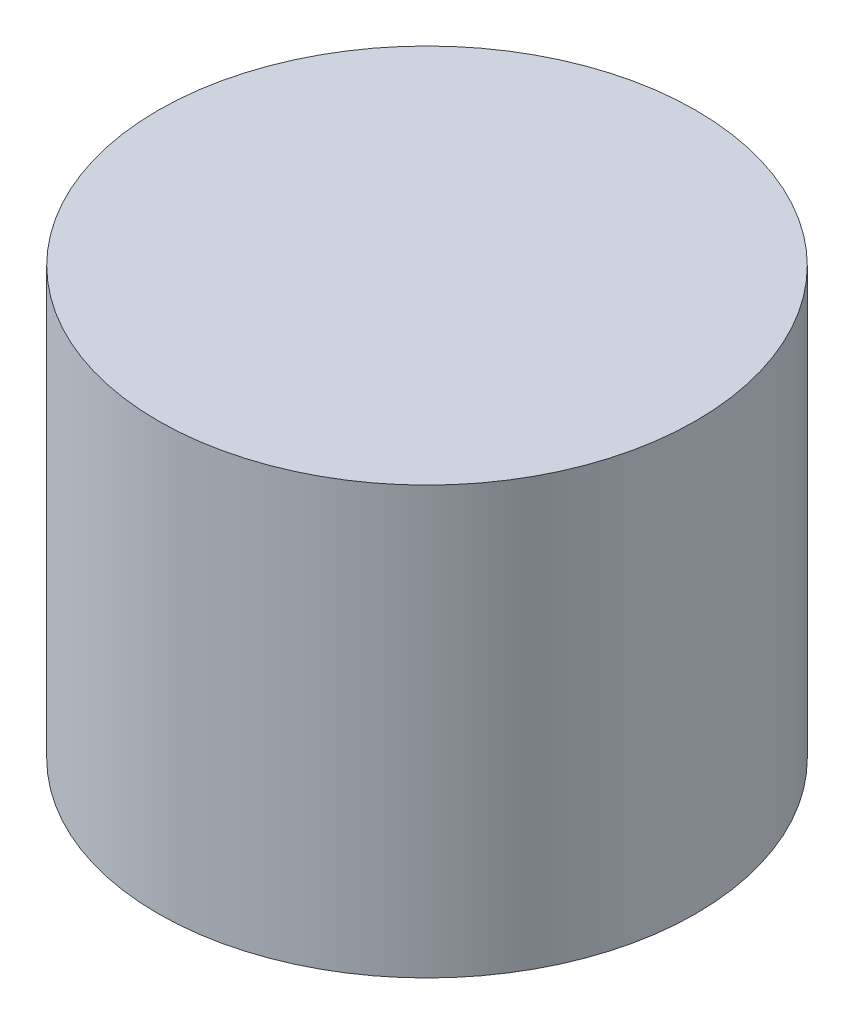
ISO-10303-21;
HEADER;
FILE_DESCRIPTION(('STEP AP214'),'2;1');
FILE_NAME('part.step','',(''),(''),'','','');
FILE_SCHEMA(('AUTOMOTIVE_DESIGN { 1 0 10303 214 1 1 1 1 }'));
ENDSEC;
DATA;
#1=APPLICATION_CONTEXT('core data for automotive mechanical design processes');
#2=APPLICATION_PROTOCOL_DEFINITION('international standard','automotive_design',2000,#1);
#3=PRODUCT_CONTEXT('',#1,'mechanical');
#4=PRODUCT('Part','Part','',(#3));
#5=PRODUCT_RELATED_PRODUCT_CATEGORY('part','',(#4));
#6=PRODUCT_DEFINITION_FORMATION('','',#4);
#7=PRODUCT_DEFINITION_CONTEXT('part definition',#1,'design');
#8=PRODUCT_DEFINITION('design','',#6,#7);
#9=PRODUCT_DEFINITION_SHAPE('','',#8);
#10=(LENGTH_UNIT() NAMED_UNIT(*) SI_UNIT(.MILLI.,.METRE.));
#11=(NAMED_UNIT(*) PLANE_ANGLE_UNIT() SI_UNIT($,.RADIAN.));
#12=(NAMED_UNIT(*) SI_UNIT($,.STERADIAN.) SOLID_ANGLE_UNIT());
#13=UNCERTAINTY_MEASURE_WITH_UNIT(LENGTH_MEASURE(1.E-05),#10,'distance_accuracy_value','');
#14=(GEOMETRIC_REPRESENTATION_CONTEXT(3) GLOBAL_UNCERTAINTY_ASSIGNED_CONTEXT((#13)) GLOBAL_UNIT_ASSIGNED_CONTEXT((#10,
#11,#12)) REPRESENTATION_CONTEXT('',''));
#15=CARTESIAN_POINT('',(0.,0.,0.));
#16=DIRECTION('',(0.,0.,1.));
#17=DIRECTION('',(1.,0.,0.));
#18=AXIS2_PLACEMENT_3D('',#15,#16,#17);
#19=CARTESIAN_POINT('',(0.,250.,0.));
#20=DIRECTION('',(0.,-1.,0.));
#21=DIRECTION('',(0.,0.,-1.));
#22=AXIS2_PLACEMENT_3D('',#19,#20,#21);
#23=CYLINDRICAL_SURFACE('',#22,315.);
#24=CARTESIAN_POINT('',(0.,250.,0.));
#25=DIRECTION('',(0.,1.,0.));
#26=DIRECTION('',(0.,0.,1.));
#27=AXIS2_PLACEMENT_3D('',#24,#25,#26);
#28=CIRCLE('',#27,315.);
#29=CARTESIAN_POINT('',(0.,250.,315.));
#30=VERTEX_POINT('',#29);
#31=EDGE_CURVE('E10',#30,#30,#28,.T.);
#32=ORIENTED_EDGE('',*,*,#31,.F.);
#33=EDGE_LOOP('',(#32));
#34=FACE_BOUND('',#33,.T.);
#35=CARTESIAN_POINT('',(0.,-250.,0.));
#36=DIRECTION('',(0.,1.,0.));
#37=DIRECTION('',(0.,0.,1.));
#38=AXIS2_PLACEMENT_3D('',#35,#36,#37);
#39=CIRCLE('',#38,315.);
#40=CARTESIAN_POINT('',(0.,-250.,315.));
#41=VERTEX_POINT('',#40);
#42=EDGE_CURVE('E30',#41,#41,#39,.T.);
#43=ORIENTED_EDGE('',*,*,#42,.T.);
#44=EDGE_LOOP('',(#43));
#45=FACE_BOUND('',#44,.T.);
#46=ADVANCED_FACE('F24',(#34,#45),#23,.T.);
#47=CARTESIAN_POINT('',(0.,250.,0.));
#48=DIRECTION('',(0.,1.,0.));
#49=DIRECTION('',(0.,0.,1.));
#50=AXIS2_PLACEMENT_3D('',#47,#48,#49);
#51=PLANE('',#50);
#52=ORIENTED_EDGE('',*,*,#31,.T.);
#53=EDGE_LOOP('',(#52));
#54=FACE_BOUND('',#53,.T.);
#55=ADVANCED_FACE('F39',(#54),#51,.T.);
#56=CARTESIAN_POINT('',(0.,-250.,0.));
#57=DIRECTION('',(0.,1.,0.));
#58=DIRECTION('',(0.,0.,1.));
#59=AXIS2_PLACEMENT_3D('',#56,#57,#58);
#60=PLANE('',#59);
#61=ORIENTED_EDGE('',*,*,#42,.F.);
#62=EDGE_LOOP('',(#61));
#63=FACE_BOUND('',#62,.T.);
#64=ADVANCED_FACE('F37',(#63),#60,.F.);
#65=CLOSED_SHELL('',(#46,#55,#64));
#66=MANIFOLD_SOLID_BREP('B2',#65);
#67=ADVANCED_BREP_SHAPE_REPRESENTATION('',(#18,#66),#14);
#68=SHAPE_DEFINITION_REPRESENTATION(#9,#67);
ENDSEC;
END-ISO-10303-21;
